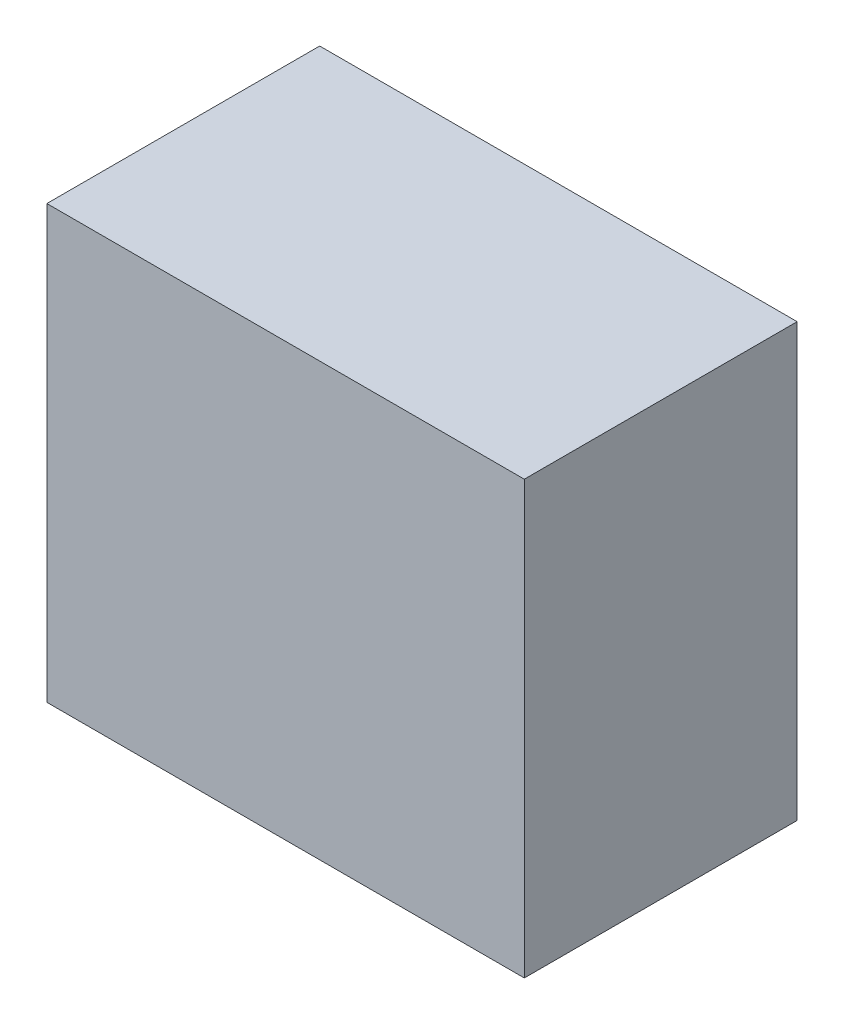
ISO-10303-21;
HEADER;
FILE_DESCRIPTION(('STEP AP214'),'2;1');
FILE_NAME('part.step','',(''),(''),'','','');
FILE_SCHEMA(('AUTOMOTIVE_DESIGN { 1 0 10303 214 1 1 1 1 }'));
ENDSEC;
DATA;
#1=APPLICATION_CONTEXT('core data for automotive mechanical design processes');
#2=APPLICATION_PROTOCOL_DEFINITION('international standard','automotive_design',2000,#1);
#3=PRODUCT_CONTEXT('',#1,'mechanical');
#4=PRODUCT('Part','Part','',(#3));
#5=PRODUCT_RELATED_PRODUCT_CATEGORY('part','',(#4));
#6=PRODUCT_DEFINITION_FORMATION('','',#4);
#7=PRODUCT_DEFINITION_CONTEXT('part definition',#1,'design');
#8=PRODUCT_DEFINITION('design','',#6,#7);
#9=PRODUCT_DEFINITION_SHAPE('','',#8);
#10=(LENGTH_UNIT() NAMED_UNIT(*) SI_UNIT(.MILLI.,.METRE.));
#11=(NAMED_UNIT(*) PLANE_ANGLE_UNIT() SI_UNIT($,.RADIAN.));
#12=(NAMED_UNIT(*) SI_UNIT($,.STERADIAN.) SOLID_ANGLE_UNIT());
#13=UNCERTAINTY_MEASURE_WITH_UNIT(LENGTH_MEASURE(1.E-05),#10,'distance_accuracy_value','');
#14=(GEOMETRIC_REPRESENTATION_CONTEXT(3) GLOBAL_UNCERTAINTY_ASSIGNED_CONTEXT((#13)) GLOBAL_UNIT_ASSIGNED_CONTEXT((#10,
#11,#12)) REPRESENTATION_CONTEXT('',''));
#15=CARTESIAN_POINT('',(0.,0.,0.));
#16=DIRECTION('',(0.,0.,1.));
#17=DIRECTION('',(1.,0.,0.));
#18=AXIS2_PLACEMENT_3D('',#15,#16,#17);
#19=CARTESIAN_POINT('',(0.,0.,60.));
#20=DIRECTION('',(1.,0.,0.));
#21=DIRECTION('',(0.,0.,-1.));
#22=AXIS2_PLACEMENT_3D('',#19,#20,#21);
#23=PLANE('',#22);
#24=DIRECTION('',(0.,-1.,0.));
#25=VECTOR('',#24,1.);
#26=CARTESIAN_POINT('',(0.,0.,0.));
#27=LINE('',#26,#25);
#28=CARTESIAN_POINT('',(0.,95.,0.));
#29=VERTEX_POINT('',#28);
#30=CARTESIAN_POINT('',(0.,0.,0.));
#31=VERTEX_POINT('',#30);
#32=EDGE_CURVE('E94',#29,#31,#27,.T.);
#33=ORIENTED_EDGE('',*,*,#32,.T.);
#34=DIRECTION('',(0.,0.,-1.));
#35=VECTOR('',#34,1.);
#36=CARTESIAN_POINT('',(0.,0.,60.));
#37=LINE('',#36,#35);
#38=CARTESIAN_POINT('',(0.,0.,60.));
#39=VERTEX_POINT('',#38);
#40=EDGE_CURVE('E11',#39,#31,#37,.T.);
#41=ORIENTED_EDGE('',*,*,#40,.F.);
#42=DIRECTION('',(0.,-1.,0.));
#43=VECTOR('',#42,1.);
#44=CARTESIAN_POINT('',(0.,0.,60.));
#45=LINE('',#44,#43);
#46=CARTESIAN_POINT('',(0.,95.,60.));
#47=VERTEX_POINT('',#46);
#48=EDGE_CURVE('E82',#47,#39,#45,.T.);
#49=ORIENTED_EDGE('',*,*,#48,.F.);
#50=DIRECTION('',(0.,0.,-1.));
#51=VECTOR('',#50,1.);
#52=CARTESIAN_POINT('',(0.,95.,60.));
#53=LINE('',#52,#51);
#54=EDGE_CURVE('E90',#47,#29,#53,.T.);
#55=ORIENTED_EDGE('',*,*,#54,.T.);
#56=EDGE_LOOP('',(#33,#41,#49,#55));
#57=FACE_BOUND('',#56,.T.);
#58=ADVANCED_FACE('F31',(#57),#23,.F.);
#59=CARTESIAN_POINT('',(0.,0.,60.));
#60=DIRECTION('',(0.,1.,0.));
#61=DIRECTION('',(0.,0.,1.));
#62=AXIS2_PLACEMENT_3D('',#59,#60,#61);
#63=PLANE('',#62);
#64=DIRECTION('',(1.,0.,0.));
#65=VECTOR('',#64,1.);
#66=CARTESIAN_POINT('',(0.,0.,0.));
#67=LINE('',#66,#65);
#68=CARTESIAN_POINT('',(105.,0.,0.));
#69=VERTEX_POINT('',#68);
#70=EDGE_CURVE('E86',#31,#69,#67,.T.);
#71=ORIENTED_EDGE('',*,*,#70,.T.);
#72=DIRECTION('',(0.,0.,-1.));
#73=VECTOR('',#72,1.);
#74=CARTESIAN_POINT('',(105.,0.,60.));
#75=LINE('',#74,#73);
#76=CARTESIAN_POINT('',(105.,0.,60.));
#77=VERTEX_POINT('',#76);
#78=EDGE_CURVE('E39',#77,#69,#75,.T.);
#79=ORIENTED_EDGE('',*,*,#78,.F.);
#80=DIRECTION('',(1.,0.,0.));
#81=VECTOR('',#80,1.);
#82=CARTESIAN_POINT('',(0.,0.,60.));
#83=LINE('',#82,#81);
#84=EDGE_CURVE('E77',#39,#77,#83,.T.);
#85=ORIENTED_EDGE('',*,*,#84,.F.);
#86=ORIENTED_EDGE('',*,*,#40,.T.);
#87=EDGE_LOOP('',(#71,#79,#85,#86));
#88=FACE_BOUND('',#87,.T.);
#89=ADVANCED_FACE('F85',(#88),#63,.F.);
#90=CARTESIAN_POINT('',(105.,0.,60.));
#91=DIRECTION('',(-1.,0.,0.));
#92=DIRECTION('',(0.,0.,1.));
#93=AXIS2_PLACEMENT_3D('',#90,#91,#92);
#94=PLANE('',#93);
#95=DIRECTION('',(0.,1.,0.));
#96=VECTOR('',#95,1.);
#97=CARTESIAN_POINT('',(105.,0.,0.));
#98=LINE('',#97,#96);
#99=CARTESIAN_POINT('',(105.,95.,0.));
#100=VERTEX_POINT('',#99);
#101=EDGE_CURVE('E64',#69,#100,#98,.T.);
#102=ORIENTED_EDGE('',*,*,#101,.T.);
#103=DIRECTION('',(0.,0.,-1.));
#104=VECTOR('',#103,1.);
#105=CARTESIAN_POINT('',(105.,95.,60.));
#106=LINE('',#105,#104);
#107=CARTESIAN_POINT('',(105.,95.,60.));
#108=VERTEX_POINT('',#107);
#109=EDGE_CURVE('E87',#108,#100,#106,.T.);
#110=ORIENTED_EDGE('',*,*,#109,.F.);
#111=DIRECTION('',(0.,1.,0.));
#112=VECTOR('',#111,1.);
#113=CARTESIAN_POINT('',(105.,0.,60.));
#114=LINE('',#113,#112);
#115=EDGE_CURVE('E80',#77,#108,#114,.T.);
#116=ORIENTED_EDGE('',*,*,#115,.F.);
#117=ORIENTED_EDGE('',*,*,#78,.T.);
#118=EDGE_LOOP('',(#102,#110,#116,#117));
#119=FACE_BOUND('',#118,.T.);
#120=ADVANCED_FACE('F88',(#119),#94,.F.);
#121=CARTESIAN_POINT('',(0.,95.,60.));
#122=DIRECTION('',(0.,-1.,0.));
#123=DIRECTION('',(0.,0.,-1.));
#124=AXIS2_PLACEMENT_3D('',#121,#122,#123);
#125=PLANE('',#124);
#126=DIRECTION('',(-1.,0.,0.));
#127=VECTOR('',#126,1.);
#128=CARTESIAN_POINT('',(0.,95.,0.));
#129=LINE('',#128,#127);
#130=EDGE_CURVE('E70',#100,#29,#129,.T.);
#131=ORIENTED_EDGE('',*,*,#130,.T.);
#132=ORIENTED_EDGE('',*,*,#54,.F.);
#133=DIRECTION('',(-1.,0.,0.));
#134=VECTOR('',#133,1.);
#135=CARTESIAN_POINT('',(0.,95.,60.));
#136=LINE('',#135,#134);
#137=EDGE_CURVE('E47',#108,#47,#136,.T.);
#138=ORIENTED_EDGE('',*,*,#137,.F.);
#139=ORIENTED_EDGE('',*,*,#109,.T.);
#140=EDGE_LOOP('',(#131,#132,#138,#139));
#141=FACE_BOUND('',#140,.T.);
#142=ADVANCED_FACE('F101',(#141),#125,.F.);
#143=CARTESIAN_POINT('',(0.,95.,60.));
#144=DIRECTION('',(0.,0.,-1.));
#145=DIRECTION('',(-1.,0.,0.));
#146=AXIS2_PLACEMENT_3D('',#143,#144,#145);
#147=PLANE('',#146);
#148=ORIENTED_EDGE('',*,*,#48,.T.);
#149=ORIENTED_EDGE('',*,*,#84,.T.);
#150=ORIENTED_EDGE('',*,*,#115,.T.);
#151=ORIENTED_EDGE('',*,*,#137,.T.);
#152=EDGE_LOOP('',(#148,#149,#150,#151));
#153=FACE_BOUND('',#152,.T.);
#154=ADVANCED_FACE('F78',(#153),#147,.F.);
#155=CARTESIAN_POINT('',(0.,95.,0.));
#156=DIRECTION('',(0.,0.,-1.));
#157=DIRECTION('',(-1.,0.,0.));
#158=AXIS2_PLACEMENT_3D('',#155,#156,#157);
#159=PLANE('',#158);
#160=ORIENTED_EDGE('',*,*,#32,.F.);
#161=ORIENTED_EDGE('',*,*,#130,.F.);
#162=ORIENTED_EDGE('',*,*,#101,.F.);
#163=ORIENTED_EDGE('',*,*,#70,.F.);
#164=EDGE_LOOP('',(#160,#161,#162,#163));
#165=FACE_BOUND('',#164,.T.);
#166=ADVANCED_FACE('F104',(#165),#159,.T.);
#167=CLOSED_SHELL('',(#58,#89,#120,#142,#154,#166));
#168=MANIFOLD_SOLID_BREP('B2',#167);
#169=ADVANCED_BREP_SHAPE_REPRESENTATION('',(#18,#168),#14);
#170=SHAPE_DEFINITION_REPRESENTATION(#9,#169);
ENDSEC;
END-ISO-10303-21;
